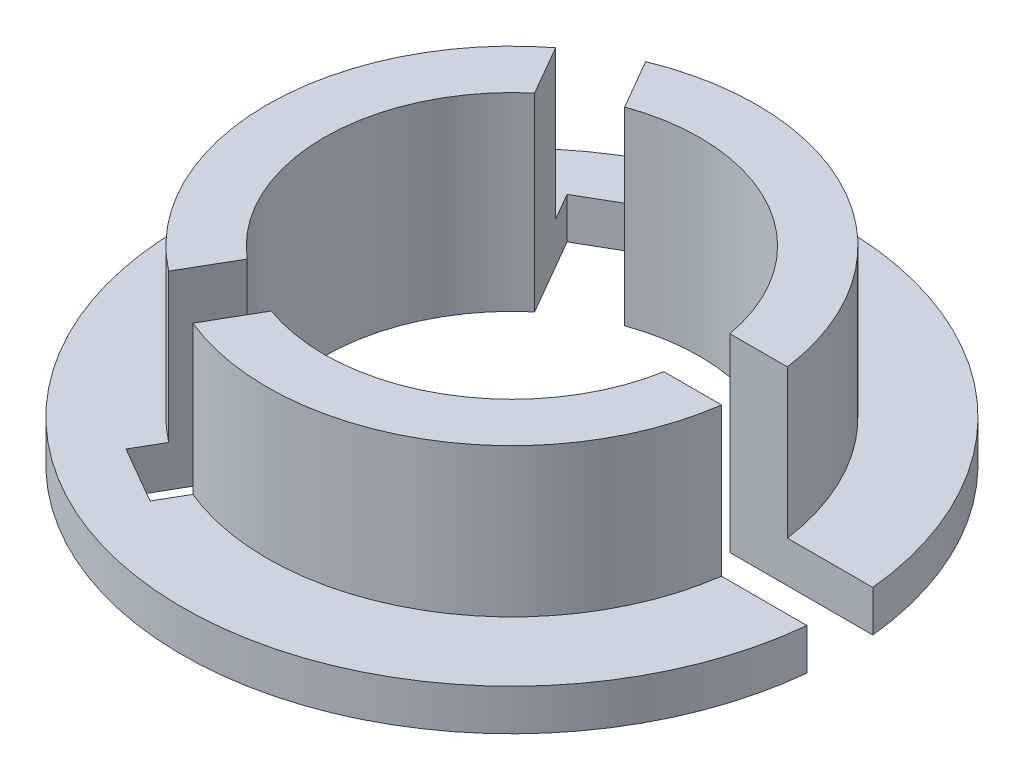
ISO-10303-21;
HEADER;
FILE_DESCRIPTION(('STEP AP214'),'2;1');
FILE_NAME('part.step','',(''),(''),'','','');
FILE_SCHEMA(('AUTOMOTIVE_DESIGN { 1 0 10303 214 1 1 1 1 }'));
ENDSEC;
DATA;
#1=APPLICATION_CONTEXT('core data for automotive mechanical design processes');
#2=APPLICATION_PROTOCOL_DEFINITION('international standard','automotive_design',2000,#1);
#3=PRODUCT_CONTEXT('',#1,'mechanical');
#4=PRODUCT('Part','Part','',(#3));
#5=PRODUCT_RELATED_PRODUCT_CATEGORY('part','',(#4));
#6=PRODUCT_DEFINITION_FORMATION('','',#4);
#7=PRODUCT_DEFINITION_CONTEXT('part definition',#1,'design');
#8=PRODUCT_DEFINITION('design','',#6,#7);
#9=PRODUCT_DEFINITION_SHAPE('','',#8);
#10=(LENGTH_UNIT() NAMED_UNIT(*) SI_UNIT(.MILLI.,.METRE.));
#11=(NAMED_UNIT(*) PLANE_ANGLE_UNIT() SI_UNIT($,.RADIAN.));
#12=(NAMED_UNIT(*) SI_UNIT($,.STERADIAN.) SOLID_ANGLE_UNIT());
#13=UNCERTAINTY_MEASURE_WITH_UNIT(LENGTH_MEASURE(1.E-05),#10,'distance_accuracy_value','');
#14=(GEOMETRIC_REPRESENTATION_CONTEXT(3) GLOBAL_UNCERTAINTY_ASSIGNED_CONTEXT((#13)) GLOBAL_UNIT_ASSIGNED_CONTEXT((#10,
#11,#12)) REPRESENTATION_CONTEXT('',''));
#15=CARTESIAN_POINT('',(0.,0.,0.));
#16=DIRECTION('',(0.,0.,1.));
#17=DIRECTION('',(1.,0.,0.));
#18=AXIS2_PLACEMENT_3D('',#15,#16,#17);
#19=CARTESIAN_POINT('',(0.,18.,0.));
#20=DIRECTION('',(0.,1.,0.));
#21=DIRECTION('',(0.,0.,1.));
#22=AXIS2_PLACEMENT_3D('',#19,#20,#21);
#23=PLANE('',#22);
#24=DIRECTION('',(-0.5,0.,-0.866025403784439));
#25=VECTOR('',#24,1.);
#26=CARTESIAN_POINT('',(-20.0736131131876,18.,-26.7685178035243));
#27=LINE('',#26,#25);
#28=CARTESIAN_POINT('',(-14.6872918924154,18.,-17.4391357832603));
#29=VERTEX_POINT('',#28);
#30=CARTESIAN_POINT('',(-18.1788051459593,18.,-23.4866141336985));
#31=VERTEX_POINT('',#30);
#32=EDGE_CURVE('E312',#29,#31,#27,.T.);
#33=ORIENTED_EDGE('',*,*,#32,.T.);
#34=CARTESIAN_POINT('',(0.,18.,0.));
#35=DIRECTION('',(0.,1.,0.));
#36=DIRECTION('',(0.,0.,1.));
#37=AXIS2_PLACEMENT_3D('',#34,#35,#36);
#38=CIRCLE('',#37,29.7);
#39=CARTESIAN_POINT('',(-18.178805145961,18.,23.4866141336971));
#40=VERTEX_POINT('',#39);
#41=EDGE_CURVE('E206',#31,#40,#38,.T.);
#42=ORIENTED_EDGE('',*,*,#41,.T.);
#43=DIRECTION('',(0.500000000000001,0.,-0.866025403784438));
#44=VECTOR('',#43,1.);
#45=CARTESIAN_POINT('',(-20.0736131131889,18.,26.7685178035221));
#46=LINE('',#45,#44);
#47=CARTESIAN_POINT('',(-14.687291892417,18.,17.4391357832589));
#48=VERTEX_POINT('',#47);
#49=EDGE_CURVE('E221',#40,#48,#46,.T.);
#50=ORIENTED_EDGE('',*,*,#49,.T.);
#51=CARTESIAN_POINT('',(0.,18.,0.));
#52=DIRECTION('',(0.,1.,0.));
#53=DIRECTION('',(0.,0.,1.));
#54=AXIS2_PLACEMENT_3D('',#51,#52,#53);
#55=CIRCLE('',#54,22.8);
#56=EDGE_CURVE('E204',#29,#48,#55,.T.);
#57=ORIENTED_EDGE('',*,*,#56,.F.);
#58=EDGE_LOOP('',(#33,#42,#50,#57));
#59=FACE_BOUND('',#58,.T.);
#60=ADVANCED_FACE('F34',(#59),#23,.T.);
#61=DIRECTION('',(-0.5,0.,0.866025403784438));
#62=VECTOR('',#61,1.);
#63=CARTESIAN_POINT('',(-13.1454098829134,18.,30.7685178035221));
#64=LINE('',#63,#62);
#65=CARTESIAN_POINT('',(-7.75908866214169,18.,21.4391357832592));
#66=VERTEX_POINT('',#65);
#67=CARTESIAN_POINT('',(-11.2506019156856,18.,27.4866141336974));
#68=VERTEX_POINT('',#67);
#69=EDGE_CURVE('E225',#66,#68,#64,.T.);
#70=ORIENTED_EDGE('',*,*,#69,.T.);
#71=CARTESIAN_POINT('',(29.429407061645,18.,4.));
#72=VERTEX_POINT('',#71);
#73=EDGE_CURVE('E203',#68,#72,#38,.T.);
#74=ORIENTED_EDGE('',*,*,#73,.T.);
#75=DIRECTION('',(-1.,0.,0.));
#76=VECTOR('',#75,1.);
#77=CARTESIAN_POINT('',(33.2190229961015,18.,4.));
#78=LINE('',#77,#76);
#79=CARTESIAN_POINT('',(22.4463805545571,18.,4.));
#80=VERTEX_POINT('',#79);
#81=EDGE_CURVE('E268',#72,#80,#78,.T.);
#82=ORIENTED_EDGE('',*,*,#81,.T.);
#83=EDGE_CURVE('E199',#66,#80,#55,.T.);
#84=ORIENTED_EDGE('',*,*,#83,.F.);
#85=EDGE_LOOP('',(#70,#74,#82,#84));
#86=FACE_BOUND('',#85,.T.);
#87=ADVANCED_FACE('F302',(#86),#23,.T.);
#88=CARTESIAN_POINT('',(0.,18.,0.));
#89=DIRECTION('',(0.,-1.,0.));
#90=DIRECTION('',(0.,0.,-1.));
#91=AXIS2_PLACEMENT_3D('',#88,#89,#90);
#92=CYLINDRICAL_SURFACE('',#91,29.7);
#93=ORIENTED_EDGE('',*,*,#41,.F.);
#94=DIRECTION('',(0.,-1.,0.));
#95=VECTOR('',#94,1.);
#96=CARTESIAN_POINT('',(-18.1788051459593,18.,-23.4866141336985));
#97=LINE('',#96,#95);
#98=CARTESIAN_POINT('',(-18.1788051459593,0.,-23.4866141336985));
#99=VERTEX_POINT('',#98);
#100=EDGE_CURVE('E260',#31,#99,#97,.T.);
#101=ORIENTED_EDGE('',*,*,#100,.T.);
#102=CARTESIAN_POINT('',(0.,0.,0.));
#103=DIRECTION('',(0.,-1.,0.));
#104=DIRECTION('',(0.,0.,-1.));
#105=AXIS2_PLACEMENT_3D('',#102,#103,#104);
#106=CIRCLE('',#105,29.7);
#107=CARTESIAN_POINT('',(-18.178805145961,0.,23.4866141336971));
#108=VERTEX_POINT('',#107);
#109=EDGE_CURVE('E190',#108,#99,#106,.T.);
#110=ORIENTED_EDGE('',*,*,#109,.F.);
#111=DIRECTION('',(0.,-1.,0.));
#112=VECTOR('',#111,1.);
#113=CARTESIAN_POINT('',(-18.178805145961,18.,23.4866141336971));
#114=LINE('',#113,#112);
#115=EDGE_CURVE('E234',#108,#40,#114,.F.);
#116=ORIENTED_EDGE('',*,*,#115,.T.);
#117=EDGE_LOOP('',(#93,#101,#110,#116));
#118=FACE_BOUND('',#117,.T.);
#119=ADVANCED_FACE('F314',(#118),#92,.T.);
#120=ORIENTED_EDGE('',*,*,#73,.F.);
#121=DIRECTION('',(0.,-1.,0.));
#122=VECTOR('',#121,1.);
#123=CARTESIAN_POINT('',(-11.2506019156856,18.,27.4866141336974));
#124=LINE('',#123,#122);
#125=CARTESIAN_POINT('',(-11.2506019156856,0.,27.4866141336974));
#126=VERTEX_POINT('',#125);
#127=EDGE_CURVE('E242',#68,#126,#124,.T.);
#128=ORIENTED_EDGE('',*,*,#127,.T.);
#129=CARTESIAN_POINT('',(29.429407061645,0.,4.));
#130=VERTEX_POINT('',#129);
#131=EDGE_CURVE('E192',#130,#126,#106,.T.);
#132=ORIENTED_EDGE('',*,*,#131,.F.);
#133=DIRECTION('',(0.,-1.,0.));
#134=VECTOR('',#133,1.);
#135=CARTESIAN_POINT('',(29.429407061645,18.,4.));
#136=LINE('',#135,#134);
#137=EDGE_CURVE('E278',#130,#72,#136,.F.);
#138=ORIENTED_EDGE('',*,*,#137,.T.);
#139=EDGE_LOOP('',(#120,#128,#132,#138));
#140=FACE_BOUND('',#139,.T.);
#141=ADVANCED_FACE('F368',(#140),#92,.T.);
#142=CARTESIAN_POINT('',(0.,18.,0.));
#143=DIRECTION('',(0.,-1.,0.));
#144=DIRECTION('',(0.,0.,-1.));
#145=AXIS2_PLACEMENT_3D('',#142,#143,#144);
#146=CYLINDRICAL_SURFACE('',#145,22.8);
#147=DIRECTION('',(0.,-1.,0.));
#148=VECTOR('',#147,1.);
#149=CARTESIAN_POINT('',(-14.6872918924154,18.,-17.4391357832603));
#150=LINE('',#149,#148);
#151=CARTESIAN_POINT('',(-14.6872918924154,-5.,-17.4391357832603));
#152=VERTEX_POINT('',#151);
#153=EDGE_CURVE('E263',#29,#152,#150,.T.);
#154=ORIENTED_EDGE('',*,*,#153,.F.);
#155=ORIENTED_EDGE('',*,*,#56,.T.);
#156=DIRECTION('',(0.,-1.,0.));
#157=VECTOR('',#156,1.);
#158=CARTESIAN_POINT('',(-14.687291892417,18.,17.4391357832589));
#159=LINE('',#158,#157);
#160=CARTESIAN_POINT('',(-14.687291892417,-5.,17.4391357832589));
#161=VERTEX_POINT('',#160);
#162=EDGE_CURVE('E238',#161,#48,#159,.F.);
#163=ORIENTED_EDGE('',*,*,#162,.F.);
#164=CARTESIAN_POINT('',(0.,-5.,0.));
#165=DIRECTION('',(0.,-1.,0.));
#166=DIRECTION('',(0.,0.,-1.));
#167=AXIS2_PLACEMENT_3D('',#164,#165,#166);
#168=CIRCLE('',#167,22.8);
#169=EDGE_CURVE('E289',#161,#152,#168,.T.);
#170=ORIENTED_EDGE('',*,*,#169,.T.);
#171=EDGE_LOOP('',(#154,#155,#163,#170));
#172=FACE_BOUND('',#171,.T.);
#173=ADVANCED_FACE('F325',(#172),#146,.F.);
#174=DIRECTION('',(0.,-1.,0.));
#175=VECTOR('',#174,1.);
#176=CARTESIAN_POINT('',(-7.75908866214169,18.,21.4391357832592));
#177=LINE('',#176,#175);
#178=CARTESIAN_POINT('',(-7.75908866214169,-5.,21.4391357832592));
#179=VERTEX_POINT('',#178);
#180=EDGE_CURVE('E215',#66,#179,#177,.T.);
#181=ORIENTED_EDGE('',*,*,#180,.F.);
#182=ORIENTED_EDGE('',*,*,#83,.T.);
#183=DIRECTION('',(0.,-1.,0.));
#184=VECTOR('',#183,1.);
#185=CARTESIAN_POINT('',(22.4463805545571,18.,4.));
#186=LINE('',#185,#184);
#187=CARTESIAN_POINT('',(22.4463805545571,-5.,4.));
#188=VERTEX_POINT('',#187);
#189=EDGE_CURVE('E281',#188,#80,#186,.F.);
#190=ORIENTED_EDGE('',*,*,#189,.F.);
#191=EDGE_CURVE('E193',#188,#179,#168,.T.);
#192=ORIENTED_EDGE('',*,*,#191,.T.);
#193=EDGE_LOOP('',(#181,#182,#190,#192));
#194=FACE_BOUND('',#193,.T.);
#195=ADVANCED_FACE('F295',(#194),#146,.F.);
#196=DIRECTION('',(0.5,0.,0.866025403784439));
#197=VECTOR('',#196,1.);
#198=CARTESIAN_POINT('',(-13.1454098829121,18.,-30.7685178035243));
#199=LINE('',#198,#197);
#200=CARTESIAN_POINT('',(-11.2506019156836,18.,-27.4866141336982));
#201=VERTEX_POINT('',#200);
#202=CARTESIAN_POINT('',(-7.75908866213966,18.,-21.4391357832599));
#203=VERTEX_POINT('',#202);
#204=EDGE_CURVE('E332',#201,#203,#199,.T.);
#205=ORIENTED_EDGE('',*,*,#204,.T.);
#206=CARTESIAN_POINT('',(22.4463805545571,18.,-4.));
#207=VERTEX_POINT('',#206);
#208=EDGE_CURVE('E200',#207,#203,#55,.T.);
#209=ORIENTED_EDGE('',*,*,#208,.F.);
#210=DIRECTION('',(1.,0.,0.));
#211=VECTOR('',#210,1.);
#212=CARTESIAN_POINT('',(33.2190229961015,18.,-4.));
#213=LINE('',#212,#211);
#214=CARTESIAN_POINT('',(29.429407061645,18.,-4.));
#215=VERTEX_POINT('',#214);
#216=EDGE_CURVE('E271',#207,#215,#213,.T.);
#217=ORIENTED_EDGE('',*,*,#216,.T.);
#218=EDGE_CURVE('E173',#215,#201,#38,.T.);
#219=ORIENTED_EDGE('',*,*,#218,.T.);
#220=EDGE_LOOP('',(#205,#209,#217,#219));
#221=FACE_BOUND('',#220,.T.);
#222=ADVANCED_FACE('F348',(#221),#23,.T.);
#223=CARTESIAN_POINT('',(-11.2506019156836,0.,-27.4866141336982));
#224=VERTEX_POINT('',#223);
#225=CARTESIAN_POINT('',(29.429407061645,0.,-4.));
#226=VERTEX_POINT('',#225);
#227=EDGE_CURVE('E188',#224,#226,#106,.T.);
#228=ORIENTED_EDGE('',*,*,#227,.F.);
#229=DIRECTION('',(0.,-1.,0.));
#230=VECTOR('',#229,1.);
#231=CARTESIAN_POINT('',(-11.2506019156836,18.,-27.4866141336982));
#232=LINE('',#231,#230);
#233=EDGE_CURVE('E252',#224,#201,#232,.F.);
#234=ORIENTED_EDGE('',*,*,#233,.T.);
#235=ORIENTED_EDGE('',*,*,#218,.F.);
#236=DIRECTION('',(0.,-1.,0.));
#237=VECTOR('',#236,1.);
#238=CARTESIAN_POINT('',(29.429407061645,18.,-4.));
#239=LINE('',#238,#237);
#240=EDGE_CURVE('E286',#215,#226,#239,.T.);
#241=ORIENTED_EDGE('',*,*,#240,.T.);
#242=EDGE_LOOP('',(#228,#234,#235,#241));
#243=FACE_BOUND('',#242,.T.);
#244=ADVANCED_FACE('F36',(#243),#92,.T.);
#245=DIRECTION('',(0.,-1.,0.));
#246=VECTOR('',#245,1.);
#247=CARTESIAN_POINT('',(-7.75908866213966,18.,-21.4391357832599));
#248=LINE('',#247,#246);
#249=CARTESIAN_POINT('',(-7.75908866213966,-5.,-21.4391357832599));
#250=VERTEX_POINT('',#249);
#251=EDGE_CURVE('E255',#250,#203,#248,.F.);
#252=ORIENTED_EDGE('',*,*,#251,.F.);
#253=CARTESIAN_POINT('',(22.4463805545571,-5.,-4.));
#254=VERTEX_POINT('',#253);
#255=EDGE_CURVE('E288',#250,#254,#168,.T.);
#256=ORIENTED_EDGE('',*,*,#255,.T.);
#257=DIRECTION('',(0.,-1.,0.));
#258=VECTOR('',#257,1.);
#259=CARTESIAN_POINT('',(22.4463805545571,18.,-4.));
#260=LINE('',#259,#258);
#261=EDGE_CURVE('E169',#207,#254,#260,.T.);
#262=ORIENTED_EDGE('',*,*,#261,.F.);
#263=ORIENTED_EDGE('',*,*,#208,.T.);
#264=EDGE_LOOP('',(#252,#256,#262,#263));
#265=FACE_BOUND('',#264,.T.);
#266=ADVANCED_FACE('F349',(#265),#146,.F.);
#267=CARTESIAN_POINT('',(0.,0.,0.));
#268=DIRECTION('',(0.,-1.,0.));
#269=DIRECTION('',(0.,0.,-1.));
#270=AXIS2_PLACEMENT_3D('',#267,#268,#269);
#271=PLANE('',#270);
#272=CARTESIAN_POINT('',(0.,0.,0.));
#273=DIRECTION('',(0.,-1.,0.));
#274=DIRECTION('',(0.,0.,-1.));
#275=AXIS2_PLACEMENT_3D('',#272,#273,#274);
#276=CIRCLE('',#275,40.);
#277=CARTESIAN_POINT('',(39.7994974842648,0.,4.));
#278=VERTEX_POINT('',#277);
#279=CARTESIAN_POINT('',(39.7994974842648,0.,-4.));
#280=VERTEX_POINT('',#279);
#281=EDGE_CURVE('E181',#278,#280,#276,.T.);
#282=ORIENTED_EDGE('',*,*,#281,.F.);
#283=DIRECTION('',(-1.,0.,0.));
#284=VECTOR('',#283,1.);
#285=CARTESIAN_POINT('',(0.,0.,3.99999999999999));
#286=LINE('',#285,#284);
#287=EDGE_CURVE('E274',#278,#130,#286,.T.);
#288=ORIENTED_EDGE('',*,*,#287,.T.);
#289=ORIENTED_EDGE('',*,*,#131,.T.);
#290=DIRECTION('',(-0.5,0.,0.866025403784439));
#291=VECTOR('',#290,1.);
#292=CARTESIAN_POINT('',(3.46410161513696,0.,1.99999999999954));
#293=LINE('',#292,#291);
#294=CARTESIAN_POINT('',(-13.1454098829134,0.,30.7685178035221));
#295=VERTEX_POINT('',#294);
#296=EDGE_CURVE('E240',#126,#295,#293,.T.);
#297=ORIENTED_EDGE('',*,*,#296,.T.);
#298=DIRECTION('',(-0.866025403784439,0.,-0.5));
#299=VECTOR('',#298,1.);
#300=CARTESIAN_POINT('',(-16.6095114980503,0.,28.7685178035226));
#301=LINE('',#300,#299);
#302=CARTESIAN_POINT('',(-20.0736131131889,0.,26.7685178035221));
#303=VERTEX_POINT('',#302);
#304=EDGE_CURVE('E246',#295,#303,#301,.T.);
#305=ORIENTED_EDGE('',*,*,#304,.T.);
#306=DIRECTION('',(0.500000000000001,0.,-0.866025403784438));
#307=VECTOR('',#306,1.);
#308=CARTESIAN_POINT('',(-3.46410161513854,0.,-2.00000000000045));
#309=LINE('',#308,#307);
#310=EDGE_CURVE('E231',#303,#108,#309,.T.);
#311=ORIENTED_EDGE('',*,*,#310,.T.);
#312=ORIENTED_EDGE('',*,*,#109,.T.);
#313=DIRECTION('',(-0.5,0.,-0.866025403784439));
#314=VECTOR('',#313,1.);
#315=CARTESIAN_POINT('',(-3.46410161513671,0.,1.9999999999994));
#316=LINE('',#315,#314);
#317=CARTESIAN_POINT('',(-20.0736131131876,0.,-26.7685178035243));
#318=VERTEX_POINT('',#317);
#319=EDGE_CURVE('E257',#99,#318,#316,.T.);
#320=ORIENTED_EDGE('',*,*,#319,.T.);
#321=DIRECTION('',(0.866025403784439,0.,-0.5));
#322=VECTOR('',#321,1.);
#323=CARTESIAN_POINT('',(-16.6095114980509,0.,-28.7685178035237));
#324=LINE('',#323,#322);
#325=CARTESIAN_POINT('',(-13.1454098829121,0.,-30.7685178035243));
#326=VERTEX_POINT('',#325);
#327=EDGE_CURVE('E265',#318,#326,#324,.T.);
#328=ORIENTED_EDGE('',*,*,#327,.T.);
#329=DIRECTION('',(0.5,0.,0.866025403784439));
#330=VECTOR('',#329,1.);
#331=CARTESIAN_POINT('',(3.46410161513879,0.,-2.00000000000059));
#332=LINE('',#331,#330);
#333=EDGE_CURVE('E249',#326,#224,#332,.T.);
#334=ORIENTED_EDGE('',*,*,#333,.T.);
#335=ORIENTED_EDGE('',*,*,#227,.T.);
#336=DIRECTION('',(1.,0.,0.));
#337=VECTOR('',#336,1.);
#338=CARTESIAN_POINT('',(0.,0.,-3.99999999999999));
#339=LINE('',#338,#337);
#340=EDGE_CURVE('E284',#226,#280,#339,.T.);
#341=ORIENTED_EDGE('',*,*,#340,.T.);
#342=EDGE_LOOP('',(#282,#288,#289,#297,#305,#311,#312,#320,#328,#334,#335,#341));
#343=FACE_BOUND('',#342,.T.);
#344=ADVANCED_FACE('F320',(#343),#271,.F.);
#345=CARTESIAN_POINT('',(0.,-5.,0.));
#346=DIRECTION('',(0.,-1.,0.));
#347=DIRECTION('',(0.,0.,-1.));
#348=AXIS2_PLACEMENT_3D('',#345,#346,#347);
#349=PLANE('',#348);
#350=DIRECTION('',(-1.,0.,0.));
#351=VECTOR('',#350,1.);
#352=CARTESIAN_POINT('',(33.2190229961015,-5.,4.));
#353=LINE('',#352,#351);
#354=CARTESIAN_POINT('',(39.7994974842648,-5.,4.));
#355=VERTEX_POINT('',#354);
#356=EDGE_CURVE('E186',#355,#188,#353,.T.);
#357=ORIENTED_EDGE('',*,*,#356,.F.);
#358=CARTESIAN_POINT('',(0.,-5.,0.));
#359=DIRECTION('',(0.,-1.,0.));
#360=DIRECTION('',(0.,0.,-1.));
#361=AXIS2_PLACEMENT_3D('',#358,#359,#360);
#362=CIRCLE('',#361,40.);
#363=CARTESIAN_POINT('',(39.7994974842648,-5.,-4.));
#364=VERTEX_POINT('',#363);
#365=EDGE_CURVE('E179',#355,#364,#362,.T.);
#366=ORIENTED_EDGE('',*,*,#365,.T.);
#367=DIRECTION('',(1.,0.,0.));
#368=VECTOR('',#367,1.);
#369=CARTESIAN_POINT('',(0.,-5.,-3.99999999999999));
#370=LINE('',#369,#368);
#371=EDGE_CURVE('E162',#254,#364,#370,.T.);
#372=ORIENTED_EDGE('',*,*,#371,.F.);
#373=ORIENTED_EDGE('',*,*,#255,.F.);
#374=DIRECTION('',(0.5,0.,0.866025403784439));
#375=VECTOR('',#374,1.);
#376=CARTESIAN_POINT('',(-13.1454098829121,-5.,-30.7685178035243));
#377=LINE('',#376,#375);
#378=CARTESIAN_POINT('',(-13.1454098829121,-5.,-30.7685178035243));
#379=VERTEX_POINT('',#378);
#380=EDGE_CURVE('E336',#379,#250,#377,.T.);
#381=ORIENTED_EDGE('',*,*,#380,.F.);
#382=DIRECTION('',(0.866025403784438,0.,-0.5));
#383=VECTOR('',#382,1.);
#384=CARTESIAN_POINT('',(-13.1454098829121,-5.,-30.7685178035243));
#385=LINE('',#384,#383);
#386=CARTESIAN_POINT('',(-20.0736131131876,-5.,-26.7685178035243));
#387=VERTEX_POINT('',#386);
#388=EDGE_CURVE('E49',#387,#379,#385,.T.);
#389=ORIENTED_EDGE('',*,*,#388,.F.);
#390=DIRECTION('',(-0.5,0.,-0.866025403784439));
#391=VECTOR('',#390,1.);
#392=CARTESIAN_POINT('',(-3.46410161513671,-5.,1.9999999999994));
#393=LINE('',#392,#391);
#394=EDGE_CURVE('E11',#152,#387,#393,.T.);
#395=ORIENTED_EDGE('',*,*,#394,.F.);
#396=ORIENTED_EDGE('',*,*,#169,.F.);
#397=DIRECTION('',(0.500000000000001,0.,-0.866025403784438));
#398=VECTOR('',#397,1.);
#399=CARTESIAN_POINT('',(-20.0736131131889,-5.,26.7685178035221));
#400=LINE('',#399,#398);
#401=CARTESIAN_POINT('',(-20.0736131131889,-5.,26.7685178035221));
#402=VERTEX_POINT('',#401);
#403=EDGE_CURVE('E219',#402,#161,#400,.T.);
#404=ORIENTED_EDGE('',*,*,#403,.F.);
#405=DIRECTION('',(-0.866025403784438,0.,-0.5));
#406=VECTOR('',#405,1.);
#407=CARTESIAN_POINT('',(-20.0736131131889,-5.,26.7685178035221));
#408=LINE('',#407,#406);
#409=CARTESIAN_POINT('',(-13.1454098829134,-5.,30.7685178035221));
#410=VERTEX_POINT('',#409);
#411=EDGE_CURVE('E57',#410,#402,#408,.T.);
#412=ORIENTED_EDGE('',*,*,#411,.F.);
#413=DIRECTION('',(-0.5,0.,0.866025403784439));
#414=VECTOR('',#413,1.);
#415=CARTESIAN_POINT('',(3.46410161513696,-5.,1.99999999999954));
#416=LINE('',#415,#414);
#417=EDGE_CURVE('E42',#179,#410,#416,.T.);
#418=ORIENTED_EDGE('',*,*,#417,.F.);
#419=ORIENTED_EDGE('',*,*,#191,.F.);
#420=EDGE_LOOP('',(#357,#366,#372,#373,#381,#389,#395,#396,#404,#412,#418,#419));
#421=FACE_BOUND('',#420,.T.);
#422=ADVANCED_FACE('F184',(#421),#349,.T.);
#423=CARTESIAN_POINT('',(0.,-5.,0.));
#424=DIRECTION('',(0.,1.,0.));
#425=DIRECTION('',(0.,0.,1.));
#426=AXIS2_PLACEMENT_3D('',#423,#424,#425);
#427=CYLINDRICAL_SURFACE('',#426,40.);
#428=ORIENTED_EDGE('',*,*,#365,.F.);
#429=DIRECTION('',(0.,1.,0.));
#430=VECTOR('',#429,1.);
#431=CARTESIAN_POINT('',(39.7994974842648,-5.,4.));
#432=LINE('',#431,#430);
#433=EDGE_CURVE('E182',#355,#278,#432,.T.);
#434=ORIENTED_EDGE('',*,*,#433,.T.);
#435=ORIENTED_EDGE('',*,*,#281,.T.);
#436=DIRECTION('',(0.,1.,0.));
#437=VECTOR('',#436,1.);
#438=CARTESIAN_POINT('',(39.7994974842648,-5.,-4.));
#439=LINE('',#438,#437);
#440=EDGE_CURVE('E166',#280,#364,#439,.F.);
#441=ORIENTED_EDGE('',*,*,#440,.T.);
#442=EDGE_LOOP('',(#428,#434,#435,#441));
#443=FACE_BOUND('',#442,.T.);
#444=ADVANCED_FACE('F177',(#443),#427,.T.);
#445=CARTESIAN_POINT('',(33.2190229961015,18.,-4.));
#446=DIRECTION('',(0.,0.,-1.));
#447=DIRECTION('',(-1.,0.,0.));
#448=AXIS2_PLACEMENT_3D('',#445,#446,#447);
#449=PLANE('',#448);
#450=ORIENTED_EDGE('',*,*,#261,.T.);
#451=ORIENTED_EDGE('',*,*,#371,.T.);
#452=ORIENTED_EDGE('',*,*,#440,.F.);
#453=ORIENTED_EDGE('',*,*,#340,.F.);
#454=ORIENTED_EDGE('',*,*,#240,.F.);
#455=ORIENTED_EDGE('',*,*,#216,.F.);
#456=EDGE_LOOP('',(#450,#451,#452,#453,#454,#455));
#457=FACE_BOUND('',#456,.T.);
#458=ADVANCED_FACE('F164',(#457),#449,.F.);
#459=CARTESIAN_POINT('',(33.2190229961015,18.,4.));
#460=DIRECTION('',(0.,0.,1.));
#461=DIRECTION('',(1.,0.,0.));
#462=AXIS2_PLACEMENT_3D('',#459,#460,#461);
#463=PLANE('',#462);
#464=ORIENTED_EDGE('',*,*,#189,.T.);
#465=ORIENTED_EDGE('',*,*,#81,.F.);
#466=ORIENTED_EDGE('',*,*,#137,.F.);
#467=ORIENTED_EDGE('',*,*,#287,.F.);
#468=ORIENTED_EDGE('',*,*,#433,.F.);
#469=ORIENTED_EDGE('',*,*,#356,.T.);
#470=EDGE_LOOP('',(#464,#465,#466,#467,#468,#469));
#471=FACE_BOUND('',#470,.T.);
#472=ADVANCED_FACE('F299',(#471),#463,.F.);
#473=CARTESIAN_POINT('',(-20.0736131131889,18.,26.7685178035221));
#474=DIRECTION('',(-0.5,0.,0.866025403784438));
#475=DIRECTION('',(0.866025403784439,0.,0.5));
#476=AXIS2_PLACEMENT_3D('',#473,#474,#475);
#477=PLANE('',#476);
#478=DIRECTION('',(0.,-1.,0.));
#479=VECTOR('',#478,1.);
#480=CARTESIAN_POINT('',(-13.1454098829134,18.,30.7685178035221));
#481=LINE('',#480,#479);
#482=EDGE_CURVE('E212',#295,#410,#481,.T.);
#483=ORIENTED_EDGE('',*,*,#482,.T.);
#484=ORIENTED_EDGE('',*,*,#411,.T.);
#485=DIRECTION('',(0.,-1.,0.));
#486=VECTOR('',#485,1.);
#487=CARTESIAN_POINT('',(-20.0736131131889,18.,26.7685178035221));
#488=LINE('',#487,#486);
#489=EDGE_CURVE('E229',#303,#402,#488,.T.);
#490=ORIENTED_EDGE('',*,*,#489,.F.);
#491=ORIENTED_EDGE('',*,*,#304,.F.);
#492=EDGE_LOOP('',(#483,#484,#490,#491));
#493=FACE_BOUND('',#492,.T.);
#494=ADVANCED_FACE('F321',(#493),#477,.F.);
#495=CARTESIAN_POINT('',(-13.1454098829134,18.,30.7685178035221));
#496=DIRECTION('',(0.866025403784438,0.,0.5));
#497=DIRECTION('',(0.5,0.,-0.866025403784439));
#498=AXIS2_PLACEMENT_3D('',#495,#496,#497);
#499=PLANE('',#498);
#500=ORIENTED_EDGE('',*,*,#180,.T.);
#501=ORIENTED_EDGE('',*,*,#417,.T.);
#502=ORIENTED_EDGE('',*,*,#482,.F.);
#503=ORIENTED_EDGE('',*,*,#296,.F.);
#504=ORIENTED_EDGE('',*,*,#127,.F.);
#505=ORIENTED_EDGE('',*,*,#69,.F.);
#506=EDGE_LOOP('',(#500,#501,#502,#503,#504,#505));
#507=FACE_BOUND('',#506,.T.);
#508=ADVANCED_FACE('F211',(#507),#499,.F.);
#509=CARTESIAN_POINT('',(-20.0736131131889,18.,26.7685178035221));
#510=DIRECTION('',(-0.866025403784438,0.,-0.500000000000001));
#511=DIRECTION('',(-0.500000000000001,0.,0.866025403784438));
#512=AXIS2_PLACEMENT_3D('',#509,#510,#511);
#513=PLANE('',#512);
#514=ORIENTED_EDGE('',*,*,#162,.T.);
#515=ORIENTED_EDGE('',*,*,#49,.F.);
#516=ORIENTED_EDGE('',*,*,#115,.F.);
#517=ORIENTED_EDGE('',*,*,#310,.F.);
#518=ORIENTED_EDGE('',*,*,#489,.T.);
#519=ORIENTED_EDGE('',*,*,#403,.T.);
#520=EDGE_LOOP('',(#514,#515,#516,#517,#518,#519));
#521=FACE_BOUND('',#520,.T.);
#522=ADVANCED_FACE('F318',(#521),#513,.F.);
#523=CARTESIAN_POINT('',(-13.1454098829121,18.,-30.7685178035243));
#524=DIRECTION('',(-0.5,0.,-0.866025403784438));
#525=DIRECTION('',(-0.866025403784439,0.,0.5));
#526=AXIS2_PLACEMENT_3D('',#523,#524,#525);
#527=PLANE('',#526);
#528=DIRECTION('',(0.,-1.,0.));
#529=VECTOR('',#528,1.);
#530=CARTESIAN_POINT('',(-20.0736131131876,18.,-26.7685178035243));
#531=LINE('',#530,#529);
#532=EDGE_CURVE('E235',#318,#387,#531,.T.);
#533=ORIENTED_EDGE('',*,*,#532,.T.);
#534=ORIENTED_EDGE('',*,*,#388,.T.);
#535=DIRECTION('',(0.,-1.,0.));
#536=VECTOR('',#535,1.);
#537=CARTESIAN_POINT('',(-13.1454098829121,18.,-30.7685178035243));
#538=LINE('',#537,#536);
#539=EDGE_CURVE('E331',#326,#379,#538,.T.);
#540=ORIENTED_EDGE('',*,*,#539,.F.);
#541=ORIENTED_EDGE('',*,*,#327,.F.);
#542=EDGE_LOOP('',(#533,#534,#540,#541));
#543=FACE_BOUND('',#542,.T.);
#544=ADVANCED_FACE('F341',(#543),#527,.F.);
#545=CARTESIAN_POINT('',(-20.0736131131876,18.,-26.7685178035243));
#546=DIRECTION('',(-0.866025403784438,0.,0.5));
#547=DIRECTION('',(0.5,0.,0.866025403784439));
#548=AXIS2_PLACEMENT_3D('',#545,#546,#547);
#549=PLANE('',#548);
#550=ORIENTED_EDGE('',*,*,#153,.T.);
#551=ORIENTED_EDGE('',*,*,#394,.T.);
#552=ORIENTED_EDGE('',*,*,#532,.F.);
#553=ORIENTED_EDGE('',*,*,#319,.F.);
#554=ORIENTED_EDGE('',*,*,#100,.F.);
#555=ORIENTED_EDGE('',*,*,#32,.F.);
#556=EDGE_LOOP('',(#550,#551,#552,#553,#554,#555));
#557=FACE_BOUND('',#556,.T.);
#558=ADVANCED_FACE('F330',(#557),#549,.F.);
#559=CARTESIAN_POINT('',(-13.1454098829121,18.,-30.7685178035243));
#560=DIRECTION('',(0.866025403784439,0.,-0.5));
#561=DIRECTION('',(-0.5,0.,-0.866025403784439));
#562=AXIS2_PLACEMENT_3D('',#559,#560,#561);
#563=PLANE('',#562);
#564=ORIENTED_EDGE('',*,*,#251,.T.);
#565=ORIENTED_EDGE('',*,*,#204,.F.);
#566=ORIENTED_EDGE('',*,*,#233,.F.);
#567=ORIENTED_EDGE('',*,*,#333,.F.);
#568=ORIENTED_EDGE('',*,*,#539,.T.);
#569=ORIENTED_EDGE('',*,*,#380,.T.);
#570=EDGE_LOOP('',(#564,#565,#566,#567,#568,#569));
#571=FACE_BOUND('',#570,.T.);
#572=ADVANCED_FACE('F350',(#571),#563,.F.);
#573=CLOSED_SHELL('',(#60,#87,#119,#141,#173,#195,#222,#244,#266,#344,#422,#444,#458,#472,#494,
#508,#522,#544,#558,#572));
#574=MANIFOLD_SOLID_BREP('B2',#573);
#575=ADVANCED_BREP_SHAPE_REPRESENTATION('',(#18,#574),#14);
#576=SHAPE_DEFINITION_REPRESENTATION(#9,#575);
ENDSEC;
END-ISO-10303-21;
